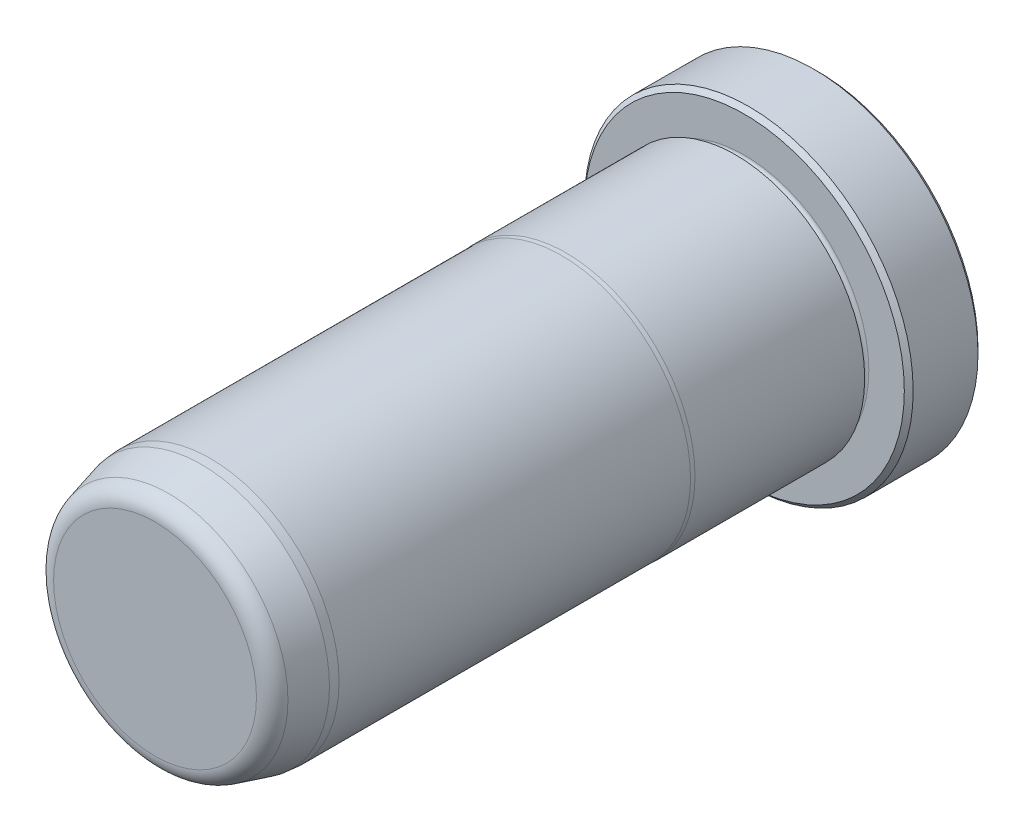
ISO-10303-21;
HEADER;
FILE_DESCRIPTION(('STEP AP214'),'2;1');
FILE_NAME('part.step','',(''),(''),'','','');
FILE_SCHEMA(('AUTOMOTIVE_DESIGN { 1 0 10303 214 1 1 1 1 }'));
ENDSEC;
DATA;
#1=APPLICATION_CONTEXT('core data for automotive mechanical design processes');
#2=APPLICATION_PROTOCOL_DEFINITION('international standard','automotive_design',2000,#1);
#3=PRODUCT_CONTEXT('',#1,'mechanical');
#4=PRODUCT('Part','Part','',(#3));
#5=PRODUCT_RELATED_PRODUCT_CATEGORY('part','',(#4));
#6=PRODUCT_DEFINITION_FORMATION('','',#4);
#7=PRODUCT_DEFINITION_CONTEXT('part definition',#1,'design');
#8=PRODUCT_DEFINITION('design','',#6,#7);
#9=PRODUCT_DEFINITION_SHAPE('','',#8);
#10=(LENGTH_UNIT() NAMED_UNIT(*) SI_UNIT(.MILLI.,.METRE.));
#11=(NAMED_UNIT(*) PLANE_ANGLE_UNIT() SI_UNIT($,.RADIAN.));
#12=(NAMED_UNIT(*) SI_UNIT($,.STERADIAN.) SOLID_ANGLE_UNIT());
#13=UNCERTAINTY_MEASURE_WITH_UNIT(LENGTH_MEASURE(1.E-05),#10,'distance_accuracy_value','');
#14=(GEOMETRIC_REPRESENTATION_CONTEXT(3) GLOBAL_UNCERTAINTY_ASSIGNED_CONTEXT((#13)) GLOBAL_UNIT_ASSIGNED_CONTEXT((#10,
#11,#12)) REPRESENTATION_CONTEXT('',''));
#15=CARTESIAN_POINT('',(0.,0.,0.));
#16=DIRECTION('',(0.,0.,1.));
#17=DIRECTION('',(1.,0.,0.));
#18=AXIS2_PLACEMENT_3D('',#15,#16,#17);
#19=CARTESIAN_POINT('',(0.,0.,0.));
#20=DIRECTION('',(0.,0.,1.));
#21=DIRECTION('',(1.,0.,0.));
#22=AXIS2_PLACEMENT_3D('',#19,#20,#21);
#23=PLANE('',#22);
#24=CARTESIAN_POINT('',(0.,0.,0.));
#25=DIRECTION('',(0.,0.,1.));
#26=DIRECTION('',(1.,0.,0.));
#27=AXIS2_PLACEMENT_3D('',#24,#25,#26);
#28=CIRCLE('',#27,13.7795);
#29=CARTESIAN_POINT('',(13.7795,0.,0.));
#30=VERTEX_POINT('',#29);
#31=EDGE_CURVE('E37',#30,#30,#28,.F.);
#32=ORIENTED_EDGE('',*,*,#31,.T.);
#33=EDGE_LOOP('',(#32));
#34=FACE_BOUND('',#33,.T.);
#35=ADVANCED_FACE('F30',(#34),#23,.F.);
#36=CARTESIAN_POINT('',(0.,0.,0.));
#37=DIRECTION('',(0.,0.,1.));
#38=DIRECTION('',(1.,0.,0.));
#39=AXIS2_PLACEMENT_3D('',#36,#37,#38);
#40=CYLINDRICAL_SURFACE('',#39,14.1605);
#41=CARTESIAN_POINT('',(0.,0.,0.380999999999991));
#42=DIRECTION('',(0.,0.,1.));
#43=DIRECTION('',(1.,0.,0.));
#44=AXIS2_PLACEMENT_3D('',#41,#42,#43);
#45=CIRCLE('',#44,14.1605);
#46=CARTESIAN_POINT('',(14.1605,0.,0.380999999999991));
#47=VERTEX_POINT('',#46);
#48=EDGE_CURVE('E41',#47,#47,#45,.T.);
#49=ORIENTED_EDGE('',*,*,#48,.T.);
#50=EDGE_LOOP('',(#49));
#51=FACE_BOUND('',#50,.T.);
#52=CARTESIAN_POINT('',(0.,0.,5.969));
#53=DIRECTION('',(0.,0.,-1.));
#54=DIRECTION('',(-1.,0.,0.));
#55=AXIS2_PLACEMENT_3D('',#52,#53,#54);
#56=CIRCLE('',#55,14.1605);
#57=CARTESIAN_POINT('',(-14.1605,0.,5.969));
#58=VERTEX_POINT('',#57);
#59=EDGE_CURVE('E45',#58,#58,#56,.T.);
#60=ORIENTED_EDGE('',*,*,#59,.T.);
#61=EDGE_LOOP('',(#60));
#62=FACE_BOUND('',#61,.T.);
#63=ADVANCED_FACE('F118',(#51,#62),#40,.T.);
#64=CARTESIAN_POINT('',(0.,14.1605,6.35));
#65=DIRECTION('',(0.,0.,-1.));
#66=DIRECTION('',(-1.,0.,0.));
#67=AXIS2_PLACEMENT_3D('',#64,#65,#66);
#68=PLANE('',#67);
#69=CARTESIAN_POINT('',(0.,0.,6.35));
#70=DIRECTION('',(0.,0.,-1.));
#71=DIRECTION('',(-1.,0.,0.));
#72=AXIS2_PLACEMENT_3D('',#69,#70,#71);
#73=CIRCLE('',#72,13.7795);
#74=CARTESIAN_POINT('',(-13.7795,0.,6.35));
#75=VERTEX_POINT('',#74);
#76=EDGE_CURVE('E10',#75,#75,#73,.F.);
#77=ORIENTED_EDGE('',*,*,#76,.T.);
#78=EDGE_LOOP('',(#77));
#79=FACE_BOUND('',#78,.T.);
#80=CARTESIAN_POINT('',(0.,0.,6.35));
#81=DIRECTION('',(0.,0.,1.));
#82=DIRECTION('',(1.,0.,0.));
#83=AXIS2_PLACEMENT_3D('',#80,#81,#82);
#84=CIRCLE('',#83,10.7188);
#85=CARTESIAN_POINT('',(10.7188,0.,6.35));
#86=VERTEX_POINT('',#85);
#87=EDGE_CURVE('E56',#86,#86,#84,.T.);
#88=ORIENTED_EDGE('',*,*,#87,.F.);
#89=EDGE_LOOP('',(#88));
#90=FACE_BOUND('',#89,.T.);
#91=ADVANCED_FACE('F113',(#79,#90),#68,.F.);
#92=CARTESIAN_POINT('',(0.,0.,6.731));
#93=DIRECTION('',(0.,0.,1.));
#94=DIRECTION('',(1.,0.,0.));
#95=AXIS2_PLACEMENT_3D('',#92,#93,#94);
#96=TOROIDAL_SURFACE('',#95,10.7188,0.381000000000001);
#97=CARTESIAN_POINT('',(0.,0.,7.112));
#98=DIRECTION('',(0.,0.,1.));
#99=DIRECTION('',(1.,0.,0.));
#100=AXIS2_PLACEMENT_3D('',#97,#98,#99);
#101=CIRCLE('',#100,10.7188);
#102=CARTESIAN_POINT('',(10.7188,0.,7.112));
#103=VERTEX_POINT('',#102);
#104=EDGE_CURVE('E59',#103,#103,#101,.T.);
#105=ORIENTED_EDGE('',*,*,#104,.F.);
#106=EDGE_LOOP('',(#105));
#107=FACE_BOUND('',#106,.T.);
#108=ORIENTED_EDGE('',*,*,#87,.T.);
#109=EDGE_LOOP('',(#108));
#110=FACE_BOUND('',#109,.T.);
#111=ADVANCED_FACE('F107',(#107,#110),#96,.F.);
#112=CARTESIAN_POINT('',(0.,10.7188,7.112));
#113=DIRECTION('',(0.,0.,1.));
#114=DIRECTION('',(1.,0.,0.));
#115=AXIS2_PLACEMENT_3D('',#112,#113,#114);
#116=PLANE('',#115);
#117=CARTESIAN_POINT('',(0.,0.,7.112));
#118=DIRECTION('',(0.,0.,1.));
#119=DIRECTION('',(1.,0.,0.));
#120=AXIS2_PLACEMENT_3D('',#117,#118,#119);
#121=CIRCLE('',#120,11.1252);
#122=CARTESIAN_POINT('',(11.1252,0.,7.112));
#123=VERTEX_POINT('',#122);
#124=EDGE_CURVE('E62',#123,#123,#121,.T.);
#125=ORIENTED_EDGE('',*,*,#124,.F.);
#126=EDGE_LOOP('',(#125));
#127=FACE_BOUND('',#126,.T.);
#128=ORIENTED_EDGE('',*,*,#104,.T.);
#129=EDGE_LOOP('',(#128));
#130=FACE_BOUND('',#129,.T.);
#131=ADVANCED_FACE('F101',(#127,#130),#116,.F.);
#132=CARTESIAN_POINT('',(0.,0.,0.));
#133=DIRECTION('',(0.,0.,1.));
#134=DIRECTION('',(1.,0.,0.));
#135=AXIS2_PLACEMENT_3D('',#132,#133,#134);
#136=CYLINDRICAL_SURFACE('',#135,11.1252);
#137=CARTESIAN_POINT('',(0.,0.,21.7347630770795));
#138=DIRECTION('',(0.,0.,1.));
#139=DIRECTION('',(1.,0.,0.));
#140=AXIS2_PLACEMENT_3D('',#137,#138,#139);
#141=CIRCLE('',#140,11.1252);
#142=CARTESIAN_POINT('',(11.1252,0.,21.7347630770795));
#143=VERTEX_POINT('',#142);
#144=EDGE_CURVE('E65',#143,#143,#141,.T.);
#145=ORIENTED_EDGE('',*,*,#144,.F.);
#146=EDGE_LOOP('',(#145));
#147=FACE_BOUND('',#146,.T.);
#148=ORIENTED_EDGE('',*,*,#124,.T.);
#149=EDGE_LOOP('',(#148));
#150=FACE_BOUND('',#149,.T.);
#151=ADVANCED_FACE('F95',(#147,#150),#136,.T.);
#152=CARTESIAN_POINT('',(0.,0.,21.7347630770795));
#153=DIRECTION('',(0.,0.,-1.));
#154=DIRECTION('',(-1.,0.,0.));
#155=AXIS2_PLACEMENT_3D('',#152,#153,#154);
#156=CONICAL_SURFACE('',#155,11.1252,0.0698131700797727);
#157=CARTESIAN_POINT('',(0.,0.,22.098));
#158=DIRECTION('',(0.,0.,1.));
#159=DIRECTION('',(1.,0.,0.));
#160=AXIS2_PLACEMENT_3D('',#157,#158,#159);
#161=CIRCLE('',#160,11.0998);
#162=CARTESIAN_POINT('',(11.0998,0.,22.098));
#163=VERTEX_POINT('',#162);
#164=EDGE_CURVE('E68',#163,#163,#161,.T.);
#165=ORIENTED_EDGE('',*,*,#164,.F.);
#166=EDGE_LOOP('',(#165));
#167=FACE_BOUND('',#166,.T.);
#168=ORIENTED_EDGE('',*,*,#144,.T.);
#169=EDGE_LOOP('',(#168));
#170=FACE_BOUND('',#169,.T.);
#171=ADVANCED_FACE('F89',(#167,#170),#156,.T.);
#172=CARTESIAN_POINT('',(0.,0.,0.));
#173=DIRECTION('',(0.,0.,1.));
#174=DIRECTION('',(1.,0.,0.));
#175=AXIS2_PLACEMENT_3D('',#172,#173,#174);
#176=CYLINDRICAL_SURFACE('',#175,11.0998);
#177=CARTESIAN_POINT('',(0.,0.,52.3875));
#178=DIRECTION('',(0.,0.,1.));
#179=DIRECTION('',(1.,0.,0.));
#180=AXIS2_PLACEMENT_3D('',#177,#178,#179);
#181=CIRCLE('',#180,11.0998);
#182=CARTESIAN_POINT('',(11.0998,0.,52.3875));
#183=VERTEX_POINT('',#182);
#184=EDGE_CURVE('E71',#183,#183,#181,.T.);
#185=ORIENTED_EDGE('',*,*,#184,.F.);
#186=EDGE_LOOP('',(#185));
#187=FACE_BOUND('',#186,.T.);
#188=ORIENTED_EDGE('',*,*,#164,.T.);
#189=EDGE_LOOP('',(#188));
#190=FACE_BOUND('',#189,.T.);
#191=ADVANCED_FACE('F83',(#187,#190),#176,.T.);
#192=CARTESIAN_POINT('',(0.,0.,52.3875));
#193=DIRECTION('',(0.,0.,-1.));
#194=DIRECTION('',(-1.,0.,0.));
#195=AXIS2_PLACEMENT_3D('',#192,#193,#194);
#196=CONICAL_SURFACE('',#195,11.0998,0.0872664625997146);
#197=CARTESIAN_POINT('',(0.,0.,53.1495));
#198=DIRECTION('',(0.,0.,1.));
#199=DIRECTION('',(1.,0.,0.));
#200=AXIS2_PLACEMENT_3D('',#197,#198,#199);
#201=CIRCLE('',#200,11.0331336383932);
#202=CARTESIAN_POINT('',(11.0331336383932,0.,53.1495));
#203=VERTEX_POINT('',#202);
#204=EDGE_CURVE('E74',#203,#203,#201,.T.);
#205=ORIENTED_EDGE('',*,*,#204,.F.);
#206=EDGE_LOOP('',(#205));
#207=FACE_BOUND('',#206,.T.);
#208=ORIENTED_EDGE('',*,*,#184,.T.);
#209=EDGE_LOOP('',(#208));
#210=FACE_BOUND('',#209,.T.);
#211=ADVANCED_FACE('F80',(#207,#210),#196,.T.);
#212=CARTESIAN_POINT('',(0.,0.,53.1495));
#213=DIRECTION('',(0.,0.,-1.));
#214=DIRECTION('',(-1.,0.,0.));
#215=AXIS2_PLACEMENT_3D('',#212,#213,#214);
#216=CONICAL_SURFACE('',#215,11.0331336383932,0.26179938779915);
#217=CARTESIAN_POINT('',(0.,0.,55.9733752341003));
#218=DIRECTION('',(0.,0.,1.));
#219=DIRECTION('',(1.,0.,0.));
#220=AXIS2_PLACEMENT_3D('',#217,#218,#219);
#221=CIRCLE('',#220,10.2764785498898);
#222=CARTESIAN_POINT('',(10.2764785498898,0.,55.9733752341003));
#223=VERTEX_POINT('',#222);
#224=EDGE_CURVE('E50',#223,#223,#221,.F.);
#225=ORIENTED_EDGE('',*,*,#224,.T.);
#226=EDGE_LOOP('',(#225));
#227=FACE_BOUND('',#226,.T.);
#228=ORIENTED_EDGE('',*,*,#204,.T.);
#229=EDGE_LOOP('',(#228));
#230=FACE_BOUND('',#229,.T.);
#231=ADVANCED_FACE('F78',(#227,#230),#216,.T.);
#232=CARTESIAN_POINT('',(0.,9.96120289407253,57.15));
#233=DIRECTION('',(0.,0.,-1.));
#234=DIRECTION('',(-1.,0.,0.));
#235=AXIS2_PLACEMENT_3D('',#232,#233,#234);
#236=PLANE('',#235);
#237=CARTESIAN_POINT('',(0.,0.,57.15));
#238=DIRECTION('',(0.,0.,-1.));
#239=DIRECTION('',(-1.,0.,0.));
#240=AXIS2_PLACEMENT_3D('',#237,#238,#239);
#241=CIRCLE('',#240,8.74307130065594);
#242=CARTESIAN_POINT('',(-8.74307130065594,0.,57.15));
#243=VERTEX_POINT('',#242);
#244=EDGE_CURVE('E53',#243,#243,#241,.F.);
#245=ORIENTED_EDGE('',*,*,#244,.T.);
#246=EDGE_LOOP('',(#245));
#247=FACE_BOUND('',#246,.T.);
#248=ADVANCED_FACE('F133',(#247),#236,.F.);
#249=CARTESIAN_POINT('',(0.,0.,55.5625));
#250=DIRECTION('',(0.,0.,-1.));
#251=DIRECTION('',(-1.,0.,0.));
#252=AXIS2_PLACEMENT_3D('',#249,#250,#251);
#253=TOROIDAL_SURFACE('',#252,8.74307130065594,1.5875);
#254=ORIENTED_EDGE('',*,*,#224,.F.);
#255=EDGE_LOOP('',(#254));
#256=FACE_BOUND('',#255,.T.);
#257=ORIENTED_EDGE('',*,*,#244,.F.);
#258=EDGE_LOOP('',(#257));
#259=FACE_BOUND('',#258,.T.);
#260=ADVANCED_FACE('F130',(#256,#259),#253,.T.);
#261=CARTESIAN_POINT('',(0.,0.,0.380999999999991));
#262=DIRECTION('',(0.,0.,1.));
#263=DIRECTION('',(1.,0.,0.));
#264=AXIS2_PLACEMENT_3D('',#261,#262,#263);
#265=CONICAL_SURFACE('',#264,14.1605,0.785398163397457);
#266=ORIENTED_EDGE('',*,*,#31,.F.);
#267=EDGE_LOOP('',(#266));
#268=FACE_BOUND('',#267,.T.);
#269=ORIENTED_EDGE('',*,*,#48,.F.);
#270=EDGE_LOOP('',(#269));
#271=FACE_BOUND('',#270,.T.);
#272=ADVANCED_FACE('F132',(#268,#271),#265,.T.);
#273=CARTESIAN_POINT('',(0.,0.,6.35));
#274=DIRECTION('',(0.,0.,-1.));
#275=DIRECTION('',(-1.,0.,0.));
#276=AXIS2_PLACEMENT_3D('',#273,#274,#275);
#277=CONICAL_SURFACE('',#276,13.7795,0.785398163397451);
#278=ORIENTED_EDGE('',*,*,#59,.F.);
#279=EDGE_LOOP('',(#278));
#280=FACE_BOUND('',#279,.T.);
#281=ORIENTED_EDGE('',*,*,#76,.F.);
#282=EDGE_LOOP('',(#281));
#283=FACE_BOUND('',#282,.T.);
#284=ADVANCED_FACE('F32',(#280,#283),#277,.T.);
#285=CLOSED_SHELL('',(#35,#63,#91,#111,#131,#151,#171,#191,#211,#231,#248,#260,#272,#284));
#286=MANIFOLD_SOLID_BREP('B2',#285);
#287=ADVANCED_BREP_SHAPE_REPRESENTATION('',(#18,#286),#14);
#288=SHAPE_DEFINITION_REPRESENTATION(#9,#287);
ENDSEC;
END-ISO-10303-21;
